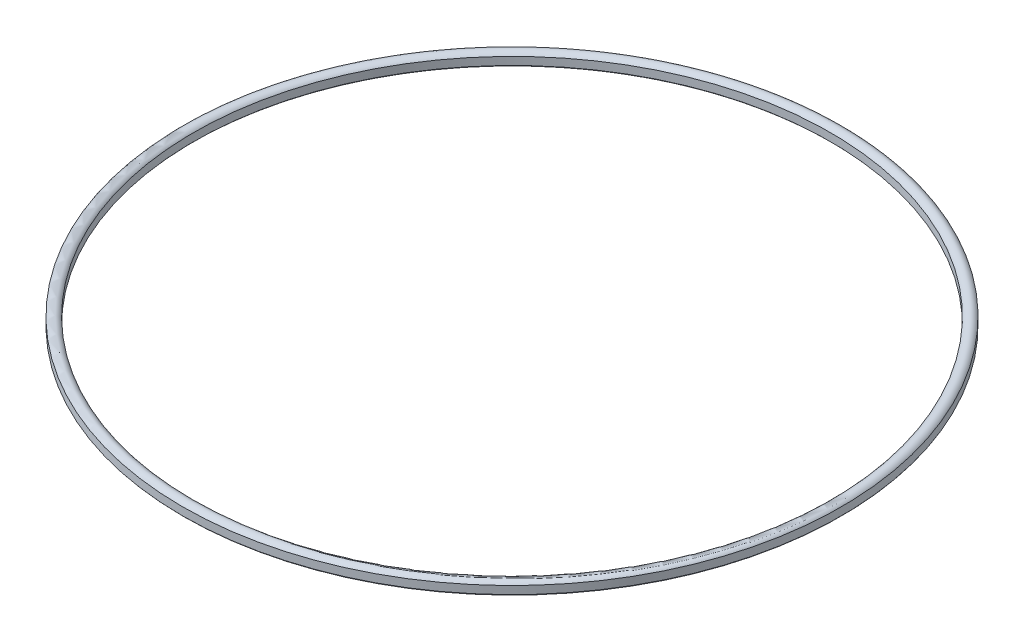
from build123d import *


with BuildPart() as part:
    # Sketch1 → Revolve1 (revolve)
    with BuildSketch(Plane.XY, mode=Mode.PRIVATE) as revolve1_sk:
        with BuildLine():
            Line((-125.222, -1.548098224), (-125.222, 1.548098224))
            ThreePointArc((-125.222, 1.548098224), (-127.3937, 2.667), (-129.5654, 1.548098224))
            Line((-129.5654, 1.548098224), (-129.5654, -1.548098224))
            ThreePointArc((-129.5654, -1.548098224), (-127.3937, -2.667), (-125.222, -1.548098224))
        make_face()
    revolve(revolve1_sk.sketch.rotate(Axis((0, 25.620116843, 0), (0, -1, 0)), 270), axis=Axis((0, 25.620116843, 0), (0, -1, 0)))


solid = part.part
